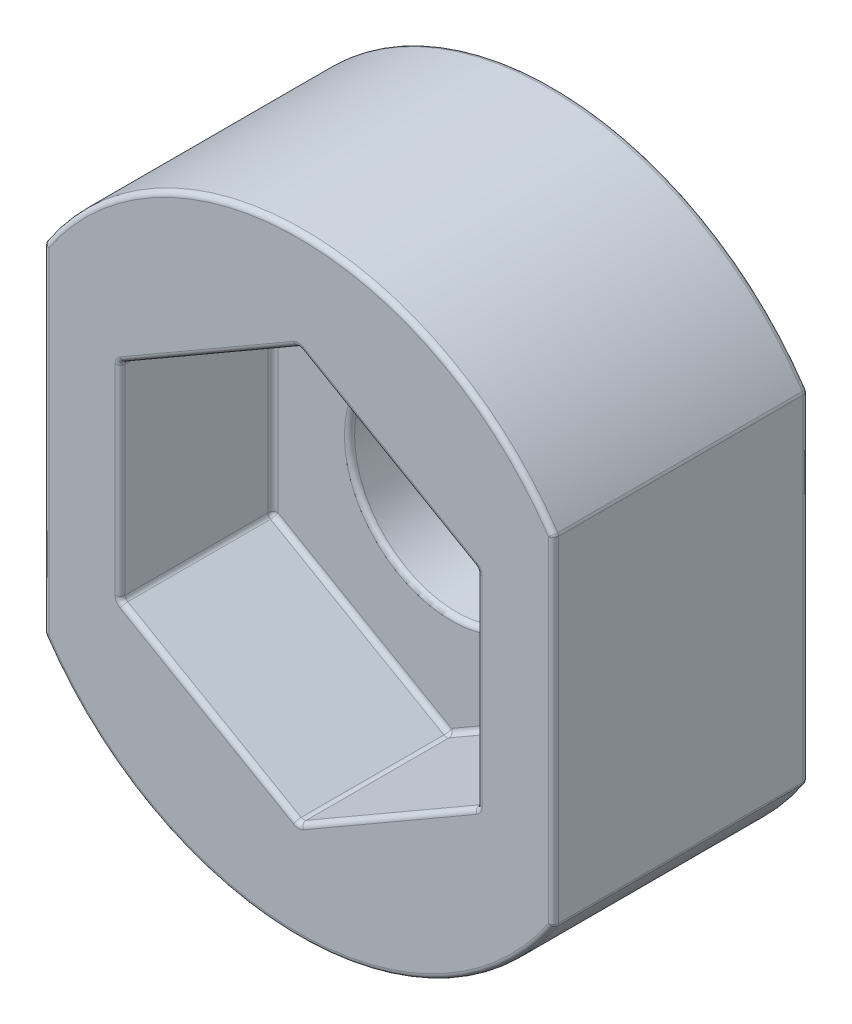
from build123d import *

# Parameters (mm, degrees)
ESQUISSE1_R             = 6
EXTRUSION1_DEPTH        = 5
ENL_V_MAT_EXTRU_1_DEPTH = 3
ESQUISSE3_W             = 3.158529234
ESQUISSE3_H             = 10.681133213
ENL_V_MAT_EXTRU_2_DEPTH = 10.848857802
ESQUISSE4_R             = 2
ENL_V_MAT_EXTRU_3_DEPTH = 9.366600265
CONG_1_R                = 0.1


with BuildPart() as part:
    # Esquisse1 → Extrusion1 (new body)
    with BuildSketch(Plane.XY):
        Circle(ESQUISSE1_R)
    extrude(amount=EXTRUSION1_DEPTH)

    # Esquisse2 → Enl_v. mat.-Extru.1 (cut)
    with BuildSketch(Plane.XY.offset(5)):
        Polygon((0, 4.041451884), (-3.5, 2.020725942), (-3.5, -2.020725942), (0, -4.041451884), (3.5, -2.020725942), (3.5, 2.020725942), align=None)
    extrude(amount=-ENL_V_MAT_EXTRU_1_DEPTH, mode=Mode.SUBTRACT)

    # Esquisse3 → Enl_v. mat.-Extru.2 (cut, through all)
    with BuildSketch(Plane.XY.offset(5)):
        with Locations((-6.579264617, 0.289330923)):
            Rectangle(ESQUISSE3_W, ESQUISSE3_H)
        with Locations((6.579264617, 0.289330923)):
            Rectangle(ESQUISSE3_W, ESQUISSE3_H)
    extrude(amount=-ENL_V_MAT_EXTRU_2_DEPTH, mode=Mode.SUBTRACT)

    # Esquisse4 → Enl_v. mat.-Extru.3 (cut, through all)
    with BuildSketch(Plane.XY.offset(2)):
        Circle(ESQUISSE4_R)
    extrude(amount=-ENL_V_MAT_EXTRU_3_DEPTH, mode=Mode.SUBTRACT)

    # Cong_1
    cong_1_edges = [part.edges().sort_by_distance(p)[0] for p in [
        (0, 6, 0),
        (-5, 3.31662479, 2.5),
        (0, 6, 5),
        (5, 3.31662479, 2.5),
        (5, 0, 0),
        (0, -6, 0),
        (-5, 0, 0),
        (-2, 0, 0),
        (-5, 0, 5),
        (-5, -3.31662479, 2.5),
        (5, 0, 5),
        (0, -6, 5),
        (-1.75, 3.031088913, 5),
        (1.75, 3.031088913, 5),
        (-3.5, 0, 5),
        (3.5, 0, 5),
        (-1.75, -3.031088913, 5),
        (1.75, -3.031088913, 5),
        (5, -3.31662479, 2.5),
        (-2, 0, 2),
        (0, 4.041451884, 3.5),
        (-3.5, 2.020725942, 3.5),
        (-1.75, 3.031088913, 2),
        (3.5, 2.020725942, 3.5),
        (1.75, 3.031088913, 2),
        (-3.5, -2.020725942, 3.5),
        (-3.5, 0, 2),
        (3.5, -2.020725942, 3.5),
        (3.5, 0, 2),
        (0, -4.041451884, 3.5),
        (-1.75, -3.031088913, 2),
        (1.75, -3.031088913, 2),
    ]]
    fillet(cong_1_edges, radius=CONG_1_R)


solid = part.part
